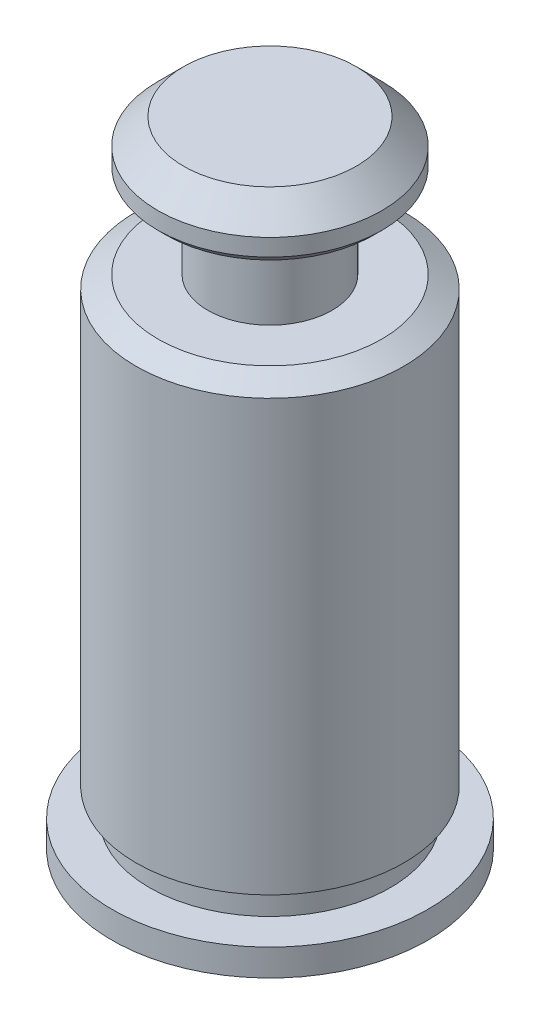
from build123d import *


with BuildPart() as part:
    # BodySke → Body (revolve)
    with BuildSketch(Plane.XY, mode=Mode.PRIVATE) as body_sk:
        Polygon((2.69, 0), (3.175, 0), (3.175, 0.538), (2.421, 0.538), (2.421, 1.1029), (2.69, 1.1029), (2.69, 9.745965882), (2.25, 10), (1.25, 10), (1.25, 11.72), (2.078333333, 11.72), (2.25, 11.891666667), (2.25, 12.235), (1.735, 12.75), (0, 12.75), (0, 0.00508), (2.69, 0.00508), align=None)
    revolve(body_sk.sketch.rotate(Axis((0, 0, 0), (0, 1, 0)), 90), axis=Axis((0, 0, 0), (0, 1, 0)))


solid = part.part
